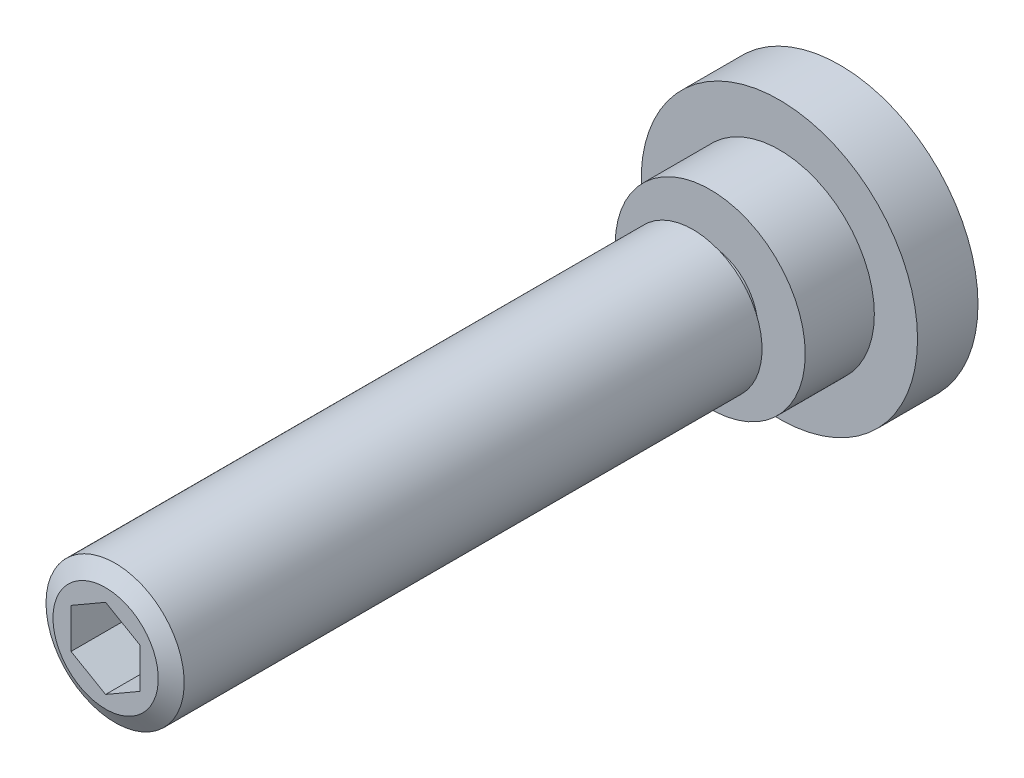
ISO-10303-21;
HEADER;
FILE_DESCRIPTION(('STEP AP214'),'2;1');
FILE_NAME('part.step','',(''),(''),'','','');
FILE_SCHEMA(('AUTOMOTIVE_DESIGN { 1 0 10303 214 1 1 1 1 }'));
ENDSEC;
DATA;
#1=APPLICATION_CONTEXT('core data for automotive mechanical design processes');
#2=APPLICATION_PROTOCOL_DEFINITION('international standard','automotive_design',2000,#1);
#3=PRODUCT_CONTEXT('',#1,'mechanical');
#4=PRODUCT('Part','Part','',(#3));
#5=PRODUCT_RELATED_PRODUCT_CATEGORY('part','',(#4));
#6=PRODUCT_DEFINITION_FORMATION('','',#4);
#7=PRODUCT_DEFINITION_CONTEXT('part definition',#1,'design');
#8=PRODUCT_DEFINITION('design','',#6,#7);
#9=PRODUCT_DEFINITION_SHAPE('','',#8);
#10=(LENGTH_UNIT() NAMED_UNIT(*) SI_UNIT(.MILLI.,.METRE.));
#11=(NAMED_UNIT(*) PLANE_ANGLE_UNIT() SI_UNIT($,.RADIAN.));
#12=(NAMED_UNIT(*) SI_UNIT($,.STERADIAN.) SOLID_ANGLE_UNIT());
#13=UNCERTAINTY_MEASURE_WITH_UNIT(LENGTH_MEASURE(1.E-05),#10,'distance_accuracy_value','');
#14=(GEOMETRIC_REPRESENTATION_CONTEXT(3) GLOBAL_UNCERTAINTY_ASSIGNED_CONTEXT((#13)) GLOBAL_UNIT_ASSIGNED_CONTEXT((#10,
#11,#12)) REPRESENTATION_CONTEXT('',''));
#15=CARTESIAN_POINT('',(0.,0.,0.));
#16=DIRECTION('',(0.,0.,1.));
#17=DIRECTION('',(1.,0.,0.));
#18=AXIS2_PLACEMENT_3D('',#15,#16,#17);
#19=CARTESIAN_POINT('',(0.,0.,0.));
#20=DIRECTION('',(0.,0.,1.));
#21=DIRECTION('',(1.,0.,0.));
#22=AXIS2_PLACEMENT_3D('',#19,#20,#21);
#23=PLANE('',#22);
#24=CARTESIAN_POINT('',(0.,0.,0.));
#25=DIRECTION('',(0.,0.,1.));
#26=DIRECTION('',(1.,0.,0.));
#27=AXIS2_PLACEMENT_3D('',#24,#25,#26);
#28=CIRCLE('',#27,16.);
#29=CARTESIAN_POINT('',(16.,0.,0.));
#30=VERTEX_POINT('',#29);
#31=EDGE_CURVE('E131',#30,#30,#28,.T.);
#32=ORIENTED_EDGE('',*,*,#31,.F.);
#33=EDGE_LOOP('',(#32));
#34=FACE_BOUND('',#33,.T.);
#35=ADVANCED_FACE('F14',(#34),#23,.F.);
#36=CARTESIAN_POINT('',(0.,0.,100.));
#37=DIRECTION('',(0.,0.,1.));
#38=DIRECTION('',(1.,0.,0.));
#39=AXIS2_PLACEMENT_3D('',#36,#37,#38);
#40=CYLINDRICAL_SURFACE('',#39,16.);
#41=CARTESIAN_POINT('',(0.,0.,7.));
#42=DIRECTION('',(0.,0.,1.));
#43=DIRECTION('',(1.,0.,0.));
#44=AXIS2_PLACEMENT_3D('',#41,#42,#43);
#45=CIRCLE('',#44,16.);
#46=CARTESIAN_POINT('',(16.,0.,7.));
#47=VERTEX_POINT('',#46);
#48=EDGE_CURVE('E128',#47,#47,#45,.T.);
#49=ORIENTED_EDGE('',*,*,#48,.F.);
#50=EDGE_LOOP('',(#49));
#51=FACE_BOUND('',#50,.T.);
#52=ORIENTED_EDGE('',*,*,#31,.T.);
#53=EDGE_LOOP('',(#52));
#54=FACE_BOUND('',#53,.T.);
#55=ADVANCED_FACE('F149',(#51,#54),#40,.T.);
#56=CARTESIAN_POINT('',(16.,0.,7.));
#57=DIRECTION('',(0.,0.,-1.));
#58=DIRECTION('',(-1.,0.,0.));
#59=AXIS2_PLACEMENT_3D('',#56,#57,#58);
#60=PLANE('',#59);
#61=CARTESIAN_POINT('',(0.,0.,7.));
#62=DIRECTION('',(0.,0.,1.));
#63=DIRECTION('',(1.,0.,0.));
#64=AXIS2_PLACEMENT_3D('',#61,#62,#63);
#65=CIRCLE('',#64,11.);
#66=CARTESIAN_POINT('',(11.,0.,7.));
#67=VERTEX_POINT('',#66);
#68=EDGE_CURVE('E125',#67,#67,#65,.T.);
#69=ORIENTED_EDGE('',*,*,#68,.F.);
#70=EDGE_LOOP('',(#69));
#71=FACE_BOUND('',#70,.T.);
#72=ORIENTED_EDGE('',*,*,#48,.T.);
#73=EDGE_LOOP('',(#72));
#74=FACE_BOUND('',#73,.T.);
#75=ADVANCED_FACE('F155',(#71,#74),#60,.F.);
#76=CARTESIAN_POINT('',(0.,0.,100.));
#77=DIRECTION('',(0.,0.,1.));
#78=DIRECTION('',(1.,0.,0.));
#79=AXIS2_PLACEMENT_3D('',#76,#77,#78);
#80=CYLINDRICAL_SURFACE('',#79,11.);
#81=CARTESIAN_POINT('',(0.,0.,15.));
#82=DIRECTION('',(0.,0.,1.));
#83=DIRECTION('',(1.,0.,0.));
#84=AXIS2_PLACEMENT_3D('',#81,#82,#83);
#85=CIRCLE('',#84,11.);
#86=CARTESIAN_POINT('',(11.,0.,15.));
#87=VERTEX_POINT('',#86);
#88=EDGE_CURVE('E116',#87,#87,#85,.T.);
#89=ORIENTED_EDGE('',*,*,#88,.F.);
#90=EDGE_LOOP('',(#89));
#91=FACE_BOUND('',#90,.T.);
#92=ORIENTED_EDGE('',*,*,#68,.T.);
#93=EDGE_LOOP('',(#92));
#94=FACE_BOUND('',#93,.T.);
#95=ADVANCED_FACE('F162',(#91,#94),#80,.T.);
#96=CARTESIAN_POINT('',(11.,0.,15.));
#97=DIRECTION('',(0.,0.,-1.));
#98=DIRECTION('',(-1.,0.,0.));
#99=AXIS2_PLACEMENT_3D('',#96,#97,#98);
#100=PLANE('',#99);
#101=ORIENTED_EDGE('',*,*,#88,.T.);
#102=EDGE_LOOP('',(#101));
#103=FACE_BOUND('',#102,.T.);
#104=CARTESIAN_POINT('',(0.,0.,15.));
#105=DIRECTION('',(0.,0.,-1.));
#106=DIRECTION('',(-1.,0.,0.));
#107=AXIS2_PLACEMENT_3D('',#104,#105,#106);
#108=CIRCLE('',#107,5.5);
#109=CARTESIAN_POINT('',(-5.5,0.,15.));
#110=VERTEX_POINT('',#109);
#111=EDGE_CURVE('E214',#110,#110,#108,.T.);
#112=ORIENTED_EDGE('',*,*,#111,.T.);
#113=EDGE_LOOP('',(#112));
#114=FACE_BOUND('',#113,.T.);
#115=ADVANCED_FACE('F166',(#103,#114),#100,.F.);
#116=CARTESIAN_POINT('',(0.,0.,0.));
#117=DIRECTION('',(0.,0.,-1.));
#118=DIRECTION('',(-1.,0.,0.));
#119=AXIS2_PLACEMENT_3D('',#116,#117,#118);
#120=CYLINDRICAL_SURFACE('',#119,5.5);
#121=ORIENTED_EDGE('',*,*,#111,.F.);
#122=EDGE_LOOP('',(#121));
#123=FACE_BOUND('',#122,.T.);
#124=CARTESIAN_POINT('',(0.,0.,15.5566243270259));
#125=DIRECTION('',(0.,0.,-1.));
#126=DIRECTION('',(-1.,0.,0.));
#127=AXIS2_PLACEMENT_3D('',#124,#125,#126);
#128=CIRCLE('',#127,5.5);
#129=CARTESIAN_POINT('',(-5.5,0.,15.5566243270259));
#130=VERTEX_POINT('',#129);
#131=EDGE_CURVE('E208',#130,#130,#128,.T.);
#132=ORIENTED_EDGE('',*,*,#131,.T.);
#133=EDGE_LOOP('',(#132));
#134=FACE_BOUND('',#133,.T.);
#135=ADVANCED_FACE('F169',(#123,#134),#120,.T.);
#136=CARTESIAN_POINT('',(0.,0.,17.));
#137=DIRECTION('',(0.,0.,1.));
#138=DIRECTION('',(1.,0.,0.));
#139=AXIS2_PLACEMENT_3D('',#136,#137,#138);
#140=CONICAL_SURFACE('',#139,8.,1.0471975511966);
#141=ORIENTED_EDGE('',*,*,#131,.F.);
#142=EDGE_LOOP('',(#141));
#143=FACE_BOUND('',#142,.T.);
#144=CARTESIAN_POINT('',(0.,0.,17.));
#145=DIRECTION('',(0.,0.,-1.));
#146=DIRECTION('',(-1.,0.,0.));
#147=AXIS2_PLACEMENT_3D('',#144,#145,#146);
#148=CIRCLE('',#147,8.);
#149=CARTESIAN_POINT('',(-8.,0.,17.));
#150=VERTEX_POINT('',#149);
#151=EDGE_CURVE('E211',#150,#150,#148,.T.);
#152=ORIENTED_EDGE('',*,*,#151,.T.);
#153=EDGE_LOOP('',(#152));
#154=FACE_BOUND('',#153,.T.);
#155=ADVANCED_FACE('F195',(#143,#154),#140,.T.);
#156=CARTESIAN_POINT('',(4.,2.30940107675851,79.));
#157=DIRECTION('',(0.,0.,-1.));
#158=DIRECTION('',(-1.,0.,0.));
#159=AXIS2_PLACEMENT_3D('',#156,#157,#158);
#160=PLANE('',#159);
#161=DIRECTION('',(-0.866025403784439,0.5,0.));
#162=VECTOR('',#161,1.);
#163=CARTESIAN_POINT('',(4.,2.30940107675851,79.));
#164=LINE('',#163,#162);
#165=CARTESIAN_POINT('',(4.,2.30940107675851,79.));
#166=VERTEX_POINT('',#165);
#167=CARTESIAN_POINT('',(0.,4.618802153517,79.));
#168=VERTEX_POINT('',#167);
#169=EDGE_CURVE('E100',#166,#168,#164,.T.);
#170=ORIENTED_EDGE('',*,*,#169,.T.);
#171=DIRECTION('',(-0.866025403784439,-0.5,0.));
#172=VECTOR('',#171,1.);
#173=CARTESIAN_POINT('',(0.,4.618802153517,79.));
#174=LINE('',#173,#172);
#175=CARTESIAN_POINT('',(-4.,2.3094010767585,79.));
#176=VERTEX_POINT('',#175);
#177=EDGE_CURVE('E103',#168,#176,#174,.T.);
#178=ORIENTED_EDGE('',*,*,#177,.T.);
#179=DIRECTION('',(0.,-1.,0.));
#180=VECTOR('',#179,1.);
#181=CARTESIAN_POINT('',(-4.,2.3094010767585,79.));
#182=LINE('',#181,#180);
#183=CARTESIAN_POINT('',(-4.,-2.3094010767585,79.));
#184=VERTEX_POINT('',#183);
#185=EDGE_CURVE('E75',#176,#184,#182,.T.);
#186=ORIENTED_EDGE('',*,*,#185,.T.);
#187=DIRECTION('',(0.866025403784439,-0.5,0.));
#188=VECTOR('',#187,1.);
#189=CARTESIAN_POINT('',(-4.,-2.3094010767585,79.));
#190=LINE('',#189,#188);
#191=CARTESIAN_POINT('',(0.,-4.618802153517,79.));
#192=VERTEX_POINT('',#191);
#193=EDGE_CURVE('E106',#184,#192,#190,.T.);
#194=ORIENTED_EDGE('',*,*,#193,.T.);
#195=DIRECTION('',(0.866025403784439,0.5,0.));
#196=VECTOR('',#195,1.);
#197=CARTESIAN_POINT('',(0.,-4.618802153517,79.));
#198=LINE('',#197,#196);
#199=CARTESIAN_POINT('',(4.,-2.3094010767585,79.));
#200=VERTEX_POINT('',#199);
#201=EDGE_CURVE('E109',#192,#200,#198,.T.);
#202=ORIENTED_EDGE('',*,*,#201,.T.);
#203=DIRECTION('',(0.,1.,0.));
#204=VECTOR('',#203,1.);
#205=CARTESIAN_POINT('',(4.,-2.3094010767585,79.));
#206=LINE('',#205,#204);
#207=EDGE_CURVE('E112',#200,#166,#206,.T.);
#208=ORIENTED_EDGE('',*,*,#207,.T.);
#209=EDGE_LOOP('',(#170,#178,#186,#194,#202,#208));
#210=FACE_BOUND('',#209,.T.);
#211=ADVANCED_FACE('F183',(#210),#160,.F.);
#212=CARTESIAN_POINT('',(-4.,2.3094010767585,79.));
#213=DIRECTION('',(-1.,0.,0.));
#214=DIRECTION('',(0.,-1.,0.));
#215=AXIS2_PLACEMENT_3D('',#212,#213,#214);
#216=PLANE('',#215);
#217=DIRECTION('',(0.,-1.,0.));
#218=VECTOR('',#217,1.);
#219=CARTESIAN_POINT('',(-4.,2.3094010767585,85.));
#220=LINE('',#219,#218);
#221=CARTESIAN_POINT('',(-4.,2.3094010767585,85.));
#222=VERTEX_POINT('',#221);
#223=CARTESIAN_POINT('',(-4.,-2.3094010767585,85.));
#224=VERTEX_POINT('',#223);
#225=EDGE_CURVE('E72',#222,#224,#220,.T.);
#226=ORIENTED_EDGE('',*,*,#225,.T.);
#227=DIRECTION('',(0.,0.,1.));
#228=VECTOR('',#227,1.);
#229=CARTESIAN_POINT('',(-4.,-2.3094010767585,79.));
#230=LINE('',#229,#228);
#231=EDGE_CURVE('E79',#184,#224,#230,.T.);
#232=ORIENTED_EDGE('',*,*,#231,.F.);
#233=ORIENTED_EDGE('',*,*,#185,.F.);
#234=DIRECTION('',(0.,0.,1.));
#235=VECTOR('',#234,1.);
#236=CARTESIAN_POINT('',(-4.,2.3094010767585,79.));
#237=LINE('',#236,#235);
#238=EDGE_CURVE('E68',#176,#222,#237,.T.);
#239=ORIENTED_EDGE('',*,*,#238,.T.);
#240=EDGE_LOOP('',(#226,#232,#233,#239));
#241=FACE_BOUND('',#240,.T.);
#242=ADVANCED_FACE('F70',(#241),#216,.F.);
#243=CARTESIAN_POINT('',(-4.,-2.3094010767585,79.));
#244=DIRECTION('',(-0.5,-0.866025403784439,0.));
#245=DIRECTION('',(0.866025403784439,-0.5,0.));
#246=AXIS2_PLACEMENT_3D('',#243,#244,#245);
#247=PLANE('',#246);
#248=DIRECTION('',(0.866025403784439,-0.5,0.));
#249=VECTOR('',#248,1.);
#250=CARTESIAN_POINT('',(-4.,-2.3094010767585,85.));
#251=LINE('',#250,#249);
#252=CARTESIAN_POINT('',(0.,-4.618802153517,85.));
#253=VERTEX_POINT('',#252);
#254=EDGE_CURVE('E90',#224,#253,#251,.T.);
#255=ORIENTED_EDGE('',*,*,#254,.T.);
#256=DIRECTION('',(0.,0.,1.));
#257=VECTOR('',#256,1.);
#258=CARTESIAN_POINT('',(0.,-4.618802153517,79.));
#259=LINE('',#258,#257);
#260=EDGE_CURVE('E119',#192,#253,#259,.T.);
#261=ORIENTED_EDGE('',*,*,#260,.F.);
#262=ORIENTED_EDGE('',*,*,#193,.F.);
#263=ORIENTED_EDGE('',*,*,#231,.T.);
#264=EDGE_LOOP('',(#255,#261,#262,#263));
#265=FACE_BOUND('',#264,.T.);
#266=ADVANCED_FACE('F182',(#265),#247,.F.);
#267=CARTESIAN_POINT('',(0.,-4.618802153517,79.));
#268=DIRECTION('',(0.5,-0.866025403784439,0.));
#269=DIRECTION('',(0.866025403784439,0.5,0.));
#270=AXIS2_PLACEMENT_3D('',#267,#268,#269);
#271=PLANE('',#270);
#272=DIRECTION('',(0.866025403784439,0.5,0.));
#273=VECTOR('',#272,1.);
#274=CARTESIAN_POINT('',(0.,-4.618802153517,85.));
#275=LINE('',#274,#273);
#276=CARTESIAN_POINT('',(4.,-2.3094010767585,85.));
#277=VERTEX_POINT('',#276);
#278=EDGE_CURVE('E92',#253,#277,#275,.T.);
#279=ORIENTED_EDGE('',*,*,#278,.T.);
#280=DIRECTION('',(0.,0.,1.));
#281=VECTOR('',#280,1.);
#282=CARTESIAN_POINT('',(4.,-2.3094010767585,79.));
#283=LINE('',#282,#281);
#284=EDGE_CURVE('E117',#200,#277,#283,.T.);
#285=ORIENTED_EDGE('',*,*,#284,.F.);
#286=ORIENTED_EDGE('',*,*,#201,.F.);
#287=ORIENTED_EDGE('',*,*,#260,.T.);
#288=EDGE_LOOP('',(#279,#285,#286,#287));
#289=FACE_BOUND('',#288,.T.);
#290=ADVANCED_FACE('F186',(#289),#271,.F.);
#291=CARTESIAN_POINT('',(4.,-2.3094010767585,79.));
#292=DIRECTION('',(1.,0.,0.));
#293=DIRECTION('',(0.,0.,-1.));
#294=AXIS2_PLACEMENT_3D('',#291,#292,#293);
#295=PLANE('',#294);
#296=DIRECTION('',(0.,1.,0.));
#297=VECTOR('',#296,1.);
#298=CARTESIAN_POINT('',(4.,-2.3094010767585,85.));
#299=LINE('',#298,#297);
#300=CARTESIAN_POINT('',(4.,2.30940107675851,85.));
#301=VERTEX_POINT('',#300);
#302=EDGE_CURVE('E98',#277,#301,#299,.T.);
#303=ORIENTED_EDGE('',*,*,#302,.T.);
#304=DIRECTION('',(0.,0.,1.));
#305=VECTOR('',#304,1.);
#306=CARTESIAN_POINT('',(4.,2.30940107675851,79.));
#307=LINE('',#306,#305);
#308=EDGE_CURVE('E36',#166,#301,#307,.T.);
#309=ORIENTED_EDGE('',*,*,#308,.F.);
#310=ORIENTED_EDGE('',*,*,#207,.F.);
#311=ORIENTED_EDGE('',*,*,#284,.T.);
#312=EDGE_LOOP('',(#303,#309,#310,#311));
#313=FACE_BOUND('',#312,.T.);
#314=ADVANCED_FACE('F177',(#313),#295,.F.);
#315=CARTESIAN_POINT('',(4.,2.30940107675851,79.));
#316=DIRECTION('',(0.5,0.866025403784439,0.));
#317=DIRECTION('',(-0.866025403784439,0.5,0.));
#318=AXIS2_PLACEMENT_3D('',#315,#316,#317);
#319=PLANE('',#318);
#320=DIRECTION('',(-0.866025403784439,0.5,0.));
#321=VECTOR('',#320,1.);
#322=CARTESIAN_POINT('',(4.,2.30940107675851,85.));
#323=LINE('',#322,#321);
#324=CARTESIAN_POINT('',(0.,4.618802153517,85.));
#325=VERTEX_POINT('',#324);
#326=EDGE_CURVE('E29',#301,#325,#323,.T.);
#327=ORIENTED_EDGE('',*,*,#326,.T.);
#328=DIRECTION('',(0.,0.,1.));
#329=VECTOR('',#328,1.);
#330=CARTESIAN_POINT('',(0.,4.618802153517,79.));
#331=LINE('',#330,#329);
#332=EDGE_CURVE('E80',#168,#325,#331,.T.);
#333=ORIENTED_EDGE('',*,*,#332,.F.);
#334=ORIENTED_EDGE('',*,*,#169,.F.);
#335=ORIENTED_EDGE('',*,*,#308,.T.);
#336=EDGE_LOOP('',(#327,#333,#334,#335));
#337=FACE_BOUND('',#336,.T.);
#338=ADVANCED_FACE('F174',(#337),#319,.F.);
#339=CARTESIAN_POINT('',(0.,4.618802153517,79.));
#340=DIRECTION('',(-0.5,0.866025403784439,0.));
#341=DIRECTION('',(-0.866025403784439,-0.5,0.));
#342=AXIS2_PLACEMENT_3D('',#339,#340,#341);
#343=PLANE('',#342);
#344=DIRECTION('',(-0.866025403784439,-0.5,0.));
#345=VECTOR('',#344,1.);
#346=CARTESIAN_POINT('',(0.,4.618802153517,85.));
#347=LINE('',#346,#345);
#348=EDGE_CURVE('E83',#325,#222,#347,.T.);
#349=ORIENTED_EDGE('',*,*,#348,.T.);
#350=ORIENTED_EDGE('',*,*,#238,.F.);
#351=ORIENTED_EDGE('',*,*,#177,.F.);
#352=ORIENTED_EDGE('',*,*,#332,.T.);
#353=EDGE_LOOP('',(#349,#350,#351,#352));
#354=FACE_BOUND('',#353,.T.);
#355=ADVANCED_FACE('F84',(#354),#343,.F.);
#356=CARTESIAN_POINT('',(8.,0.,85.));
#357=DIRECTION('',(0.,0.,-1.));
#358=DIRECTION('',(-1.,0.,0.));
#359=AXIS2_PLACEMENT_3D('',#356,#357,#358);
#360=PLANE('',#359);
#361=CARTESIAN_POINT('',(0.,0.,85.));
#362=DIRECTION('',(0.,0.,-1.));
#363=DIRECTION('',(-1.,0.,0.));
#364=AXIS2_PLACEMENT_3D('',#361,#362,#363);
#365=CIRCLE('',#364,6.09474411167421);
#366=CARTESIAN_POINT('',(-6.09474411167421,0.,85.));
#367=VERTEX_POINT('',#366);
#368=EDGE_CURVE('E22',#367,#367,#365,.F.);
#369=ORIENTED_EDGE('',*,*,#368,.T.);
#370=EDGE_LOOP('',(#369));
#371=FACE_BOUND('',#370,.T.);
#372=ORIENTED_EDGE('',*,*,#348,.F.);
#373=ORIENTED_EDGE('',*,*,#326,.F.);
#374=ORIENTED_EDGE('',*,*,#302,.F.);
#375=ORIENTED_EDGE('',*,*,#278,.F.);
#376=ORIENTED_EDGE('',*,*,#254,.F.);
#377=ORIENTED_EDGE('',*,*,#225,.F.);
#378=EDGE_LOOP('',(#372,#373,#374,#375,#376,#377));
#379=FACE_BOUND('',#378,.T.);
#380=ADVANCED_FACE('F87',(#371,#379),#360,.F.);
#381=CARTESIAN_POINT('',(0.,0.,100.));
#382=DIRECTION('',(0.,0.,1.));
#383=DIRECTION('',(1.,0.,0.));
#384=AXIS2_PLACEMENT_3D('',#381,#382,#383);
#385=CYLINDRICAL_SURFACE('',#384,8.);
#386=CARTESIAN_POINT('',(0.,0.,83.9));
#387=DIRECTION('',(0.,0.,-1.));
#388=DIRECTION('',(-1.,0.,0.));
#389=AXIS2_PLACEMENT_3D('',#386,#387,#388);
#390=CIRCLE('',#389,8.);
#391=CARTESIAN_POINT('',(-8.,0.,83.9));
#392=VERTEX_POINT('',#391);
#393=EDGE_CURVE('E9',#392,#392,#390,.T.);
#394=ORIENTED_EDGE('',*,*,#393,.T.);
#395=EDGE_LOOP('',(#394));
#396=FACE_BOUND('',#395,.T.);
#397=ORIENTED_EDGE('',*,*,#151,.F.);
#398=EDGE_LOOP('',(#397));
#399=FACE_BOUND('',#398,.T.);
#400=ADVANCED_FACE('F138',(#396,#399),#385,.T.);
#401=CARTESIAN_POINT('',(0.,0.,85.));
#402=DIRECTION('',(0.,0.,-1.));
#403=DIRECTION('',(-1.,0.,0.));
#404=AXIS2_PLACEMENT_3D('',#401,#402,#403);
#405=CONICAL_SURFACE('',#404,6.09474411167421,1.0471975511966);
#406=ORIENTED_EDGE('',*,*,#393,.F.);
#407=EDGE_LOOP('',(#406));
#408=FACE_BOUND('',#407,.T.);
#409=ORIENTED_EDGE('',*,*,#368,.F.);
#410=EDGE_LOOP('',(#409));
#411=FACE_BOUND('',#410,.T.);
#412=ADVANCED_FACE('F16',(#408,#411),#405,.T.);
#413=CLOSED_SHELL('',(#35,#55,#75,#95,#115,#135,#155,#211,#242,#266,#290,#314,#338,#355,#380,
#400,#412));
#414=MANIFOLD_SOLID_BREP('B1',#413);
#415=ADVANCED_BREP_SHAPE_REPRESENTATION('',(#18,#414),#14);
#416=SHAPE_DEFINITION_REPRESENTATION(#9,#415);
ENDSEC;
END-ISO-10303-21;
